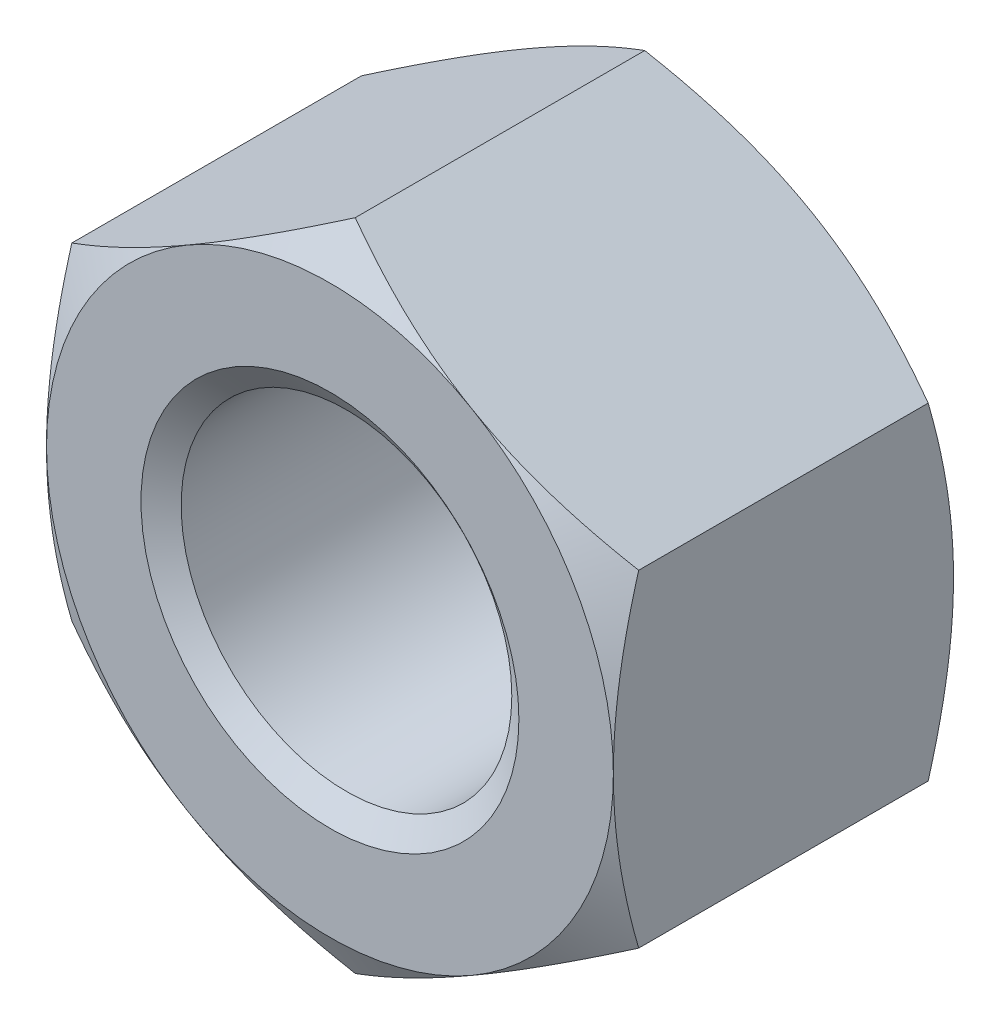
ISO-10303-21;
HEADER;
FILE_DESCRIPTION(('STEP AP214'),'2;1');
FILE_NAME('part.step','',(''),(''),'','','');
FILE_SCHEMA(('AUTOMOTIVE_DESIGN { 1 0 10303 214 1 1 1 1 }'));
ENDSEC;
DATA;
#1=APPLICATION_CONTEXT('core data for automotive mechanical design processes');
#2=APPLICATION_PROTOCOL_DEFINITION('international standard','automotive_design',2000,#1);
#3=PRODUCT_CONTEXT('',#1,'mechanical');
#4=PRODUCT('Part','Part','',(#3));
#5=PRODUCT_RELATED_PRODUCT_CATEGORY('part','',(#4));
#6=PRODUCT_DEFINITION_FORMATION('','',#4);
#7=PRODUCT_DEFINITION_CONTEXT('part definition',#1,'design');
#8=PRODUCT_DEFINITION('design','',#6,#7);
#9=PRODUCT_DEFINITION_SHAPE('','',#8);
#10=(LENGTH_UNIT() NAMED_UNIT(*) SI_UNIT(.MILLI.,.METRE.));
#11=(NAMED_UNIT(*) PLANE_ANGLE_UNIT() SI_UNIT($,.RADIAN.));
#12=(NAMED_UNIT(*) SI_UNIT($,.STERADIAN.) SOLID_ANGLE_UNIT());
#13=UNCERTAINTY_MEASURE_WITH_UNIT(LENGTH_MEASURE(1.E-05),#10,'distance_accuracy_value','');
#14=(GEOMETRIC_REPRESENTATION_CONTEXT(3) GLOBAL_UNCERTAINTY_ASSIGNED_CONTEXT((#13)) GLOBAL_UNIT_ASSIGNED_CONTEXT((#10,
#11,#12)) REPRESENTATION_CONTEXT('',''));
#15=CARTESIAN_POINT('',(0.,0.,0.));
#16=DIRECTION('',(0.,0.,1.));
#17=DIRECTION('',(1.,0.,0.));
#18=AXIS2_PLACEMENT_3D('',#15,#16,#17);
#19=CARTESIAN_POINT('',(0.,0.,-18.));
#20=DIRECTION('',(0.,0.,1.));
#21=DIRECTION('',(1.,0.,0.));
#22=AXIS2_PLACEMENT_3D('',#19,#20,#21);
#23=CYLINDRICAL_SURFACE('',#22,8.75);
#24=CARTESIAN_POINT('',(0.,0.,-0.875259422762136));
#25=DIRECTION('',(0.,0.,1.));
#26=DIRECTION('',(1.,0.,0.));
#27=AXIS2_PLACEMENT_3D('',#24,#25,#26);
#28=CIRCLE('',#27,8.75);
#29=CARTESIAN_POINT('',(8.75,0.,-0.875259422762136));
#30=VERTEX_POINT('',#29);
#31=EDGE_CURVE('E172',#30,#30,#28,.F.);
#32=ORIENTED_EDGE('',*,*,#31,.F.);
#33=EDGE_LOOP('',(#32));
#34=FACE_BOUND('',#33,.T.);
#35=CARTESIAN_POINT('',(0.,0.,-17.0993405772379));
#36=DIRECTION('',(0.,0.,-1.));
#37=DIRECTION('',(-1.,0.,0.));
#38=AXIS2_PLACEMENT_3D('',#35,#36,#37);
#39=CIRCLE('',#38,8.75);
#40=CARTESIAN_POINT('',(-8.75,0.,-17.0993405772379));
#41=VERTEX_POINT('',#40);
#42=EDGE_CURVE('E37',#41,#41,#39,.F.);
#43=ORIENTED_EDGE('',*,*,#42,.F.);
#44=EDGE_LOOP('',(#43));
#45=FACE_BOUND('',#44,.T.);
#46=ADVANCED_FACE('F32',(#34,#45),#23,.F.);
#47=CARTESIAN_POINT('',(0.,17.3205080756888,-18.));
#48=DIRECTION('',(0.,0.,-1.));
#49=DIRECTION('',(-1.,0.,0.));
#50=AXIS2_PLACEMENT_3D('',#47,#48,#49);
#51=PLANE('',#50);
#52=CARTESIAN_POINT('',(0.,0.,-18.));
#53=DIRECTION('',(0.,0.,-1.));
#54=DIRECTION('',(-1.,0.,0.));
#55=AXIS2_PLACEMENT_3D('',#52,#53,#54);
#56=CIRCLE('',#55,15.);
#57=CARTESIAN_POINT('',(-15.,0.,-18.));
#58=VERTEX_POINT('',#57);
#59=CARTESIAN_POINT('',(-7.50000000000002,-12.9903810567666,-18.));
#60=VERTEX_POINT('',#59);
#61=EDGE_CURVE('E168',#58,#60,#56,.F.);
#62=ORIENTED_EDGE('',*,*,#61,.F.);
#63=CARTESIAN_POINT('',(-7.50000000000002,12.9903810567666,-18.));
#64=VERTEX_POINT('',#63);
#65=EDGE_CURVE('E150',#64,#58,#56,.F.);
#66=ORIENTED_EDGE('',*,*,#65,.F.);
#67=CARTESIAN_POINT('',(7.50000000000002,12.9903810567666,-18.));
#68=VERTEX_POINT('',#67);
#69=EDGE_CURVE('E167',#68,#64,#56,.F.);
#70=ORIENTED_EDGE('',*,*,#69,.F.);
#71=CARTESIAN_POINT('',(0.,0.,-18.));
#72=DIRECTION('',(0.,0.,1.));
#73=DIRECTION('',(1.,0.,0.));
#74=AXIS2_PLACEMENT_3D('',#71,#72,#73);
#75=CIRCLE('',#74,15.);
#76=CARTESIAN_POINT('',(15.,0.,-18.));
#77=VERTEX_POINT('',#76);
#78=EDGE_CURVE('E242',#77,#68,#75,.T.);
#79=ORIENTED_EDGE('',*,*,#78,.F.);
#80=CARTESIAN_POINT('',(7.50000000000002,-12.9903810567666,-18.));
#81=VERTEX_POINT('',#80);
#82=EDGE_CURVE('E358',#81,#77,#56,.F.);
#83=ORIENTED_EDGE('',*,*,#82,.F.);
#84=EDGE_CURVE('E362',#60,#81,#56,.F.);
#85=ORIENTED_EDGE('',*,*,#84,.F.);
#86=EDGE_LOOP('',(#62,#66,#70,#79,#83,#85));
#87=FACE_BOUND('',#86,.T.);
#88=CARTESIAN_POINT('',(0.,0.,-18.));
#89=DIRECTION('',(0.,0.,-1.));
#90=DIRECTION('',(-1.,0.,0.));
#91=AXIS2_PLACEMENT_3D('',#88,#89,#90);
#92=CIRCLE('',#91,10.);
#93=CARTESIAN_POINT('',(-10.,0.,-18.));
#94=VERTEX_POINT('',#93);
#95=EDGE_CURVE('E175',#94,#94,#92,.F.);
#96=ORIENTED_EDGE('',*,*,#95,.T.);
#97=EDGE_LOOP('',(#96));
#98=FACE_BOUND('',#97,.T.);
#99=ADVANCED_FACE('F295',(#87,#98),#51,.T.);
#100=CARTESIAN_POINT('',(0.,17.3205080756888,0.));
#101=DIRECTION('',(0.,0.,-1.));
#102=DIRECTION('',(-1.,0.,0.));
#103=AXIS2_PLACEMENT_3D('',#100,#101,#102);
#104=PLANE('',#103);
#105=CARTESIAN_POINT('',(0.,0.,0.));
#106=DIRECTION('',(0.,0.,-1.));
#107=DIRECTION('',(-1.,0.,0.));
#108=AXIS2_PLACEMENT_3D('',#105,#106,#107);
#109=CIRCLE('',#108,15.);
#110=CARTESIAN_POINT('',(-15.,0.,0.));
#111=VERTEX_POINT('',#110);
#112=CARTESIAN_POINT('',(-7.50000000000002,12.9903810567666,0.));
#113=VERTEX_POINT('',#112);
#114=EDGE_CURVE('E11',#111,#113,#109,.T.);
#115=ORIENTED_EDGE('',*,*,#114,.F.);
#116=CARTESIAN_POINT('',(-7.50000000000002,-12.9903810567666,0.));
#117=VERTEX_POINT('',#116);
#118=EDGE_CURVE('E44',#117,#111,#109,.T.);
#119=ORIENTED_EDGE('',*,*,#118,.F.);
#120=CARTESIAN_POINT('',(7.50000000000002,-12.9903810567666,0.));
#121=VERTEX_POINT('',#120);
#122=EDGE_CURVE('E171',#121,#117,#109,.T.);
#123=ORIENTED_EDGE('',*,*,#122,.F.);
#124=CARTESIAN_POINT('',(15.,0.,0.));
#125=VERTEX_POINT('',#124);
#126=EDGE_CURVE('E349',#125,#121,#109,.T.);
#127=ORIENTED_EDGE('',*,*,#126,.F.);
#128=CARTESIAN_POINT('',(0.,0.,0.));
#129=DIRECTION('',(0.,0.,1.));
#130=DIRECTION('',(1.,0.,0.));
#131=AXIS2_PLACEMENT_3D('',#128,#129,#130);
#132=CIRCLE('',#131,15.);
#133=CARTESIAN_POINT('',(7.50000000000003,12.9903810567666,0.));
#134=VERTEX_POINT('',#133);
#135=EDGE_CURVE('E126',#125,#134,#132,.T.);
#136=ORIENTED_EDGE('',*,*,#135,.T.);
#137=EDGE_CURVE('E42',#113,#134,#109,.T.);
#138=ORIENTED_EDGE('',*,*,#137,.F.);
#139=EDGE_LOOP('',(#115,#119,#123,#127,#136,#138));
#140=FACE_BOUND('',#139,.T.);
#141=CARTESIAN_POINT('',(0.,0.,0.));
#142=DIRECTION('',(0.,0.,1.));
#143=DIRECTION('',(1.,0.,0.));
#144=AXIS2_PLACEMENT_3D('',#141,#142,#143);
#145=CIRCLE('',#144,10.);
#146=CARTESIAN_POINT('',(10.,0.,0.));
#147=VERTEX_POINT('',#146);
#148=EDGE_CURVE('E174',#147,#147,#145,.T.);
#149=ORIENTED_EDGE('',*,*,#148,.F.);
#150=EDGE_LOOP('',(#149));
#151=FACE_BOUND('',#150,.T.);
#152=ADVANCED_FACE('F247',(#140,#151),#104,.F.);
#153=CARTESIAN_POINT('',(0.,17.3205080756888,-18.));
#154=DIRECTION('',(-0.500000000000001,0.866025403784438,0.));
#155=DIRECTION('',(-0.866025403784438,-0.500000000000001,0.));
#156=AXIS2_PLACEMENT_3D('',#153,#154,#155);
#157=PLANE('',#156);
#158=DIRECTION('',(0.,0.,1.));
#159=VECTOR('',#158,1.);
#160=CARTESIAN_POINT('',(-15.,8.66025403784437,-18.));
#161=LINE('',#160,#159);
#162=CARTESIAN_POINT('',(-15.,8.66025403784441,-16.6602540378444));
#163=VERTEX_POINT('',#162);
#164=CARTESIAN_POINT('',(-15.,8.66025403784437,-1.33974596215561));
#165=VERTEX_POINT('',#164);
#166=EDGE_CURVE('E162',#163,#165,#161,.T.);
#167=ORIENTED_EDGE('',*,*,#166,.T.);
#168=CARTESIAN_POINT('',(-15.0002,8.66013856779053,-1.33981262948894));
#169=CARTESIAN_POINT('',(-14.6705058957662,8.85048754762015,-1.22992178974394));
#170=CARTESIAN_POINT('',(-14.3395258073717,9.04157899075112,-1.12501758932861));
#171=CARTESIAN_POINT('',(-13.674911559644,9.42529420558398,-0.926568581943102));
#172=CARTESIAN_POINT('',(-13.3412765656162,9.617918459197,-0.833027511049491));
#173=CARTESIAN_POINT('',(-12.6707077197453,10.0050715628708,-0.658562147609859));
#174=CARTESIAN_POINT('',(-12.333767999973,10.199603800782,-0.577667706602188));
#175=CARTESIAN_POINT('',(-11.6575472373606,10.5900200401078,-0.430232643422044));
#176=CARTESIAN_POINT('',(-11.3182663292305,10.7859039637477,-0.363691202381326));
#177=CARTESIAN_POINT('',(-10.6460568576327,11.1740042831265,-0.247792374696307));
#178=CARTESIAN_POINT('',(-10.3131781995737,11.3661918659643,-0.198051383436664));
#179=CARTESIAN_POINT('',(-9.64589556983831,11.7514476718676,-0.114646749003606));
#180=CARTESIAN_POINT('',(-9.31149156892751,11.9445159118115,-0.0809834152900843));
#181=CARTESIAN_POINT('',(-8.64212181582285,12.3309767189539,-0.0305840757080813));
#182=CARTESIAN_POINT('',(-8.30715720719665,12.5243686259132,-0.0138279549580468));
#183=CARTESIAN_POINT('',(-7.636918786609,12.9113309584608,0.00239660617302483));
#184=CARTESIAN_POINT('',(-7.30164498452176,13.1049013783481,0.00186558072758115));
#185=CARTESIAN_POINT('',(-6.6748531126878,13.4667798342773,-0.0152766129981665));
#186=CARTESIAN_POINT('',(-6.38329037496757,13.6351136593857,-0.0297968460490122));
#187=CARTESIAN_POINT('',(-5.80083556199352,13.9713941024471,-0.0716371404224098));
#188=CARTESIAN_POINT('',(-5.50994353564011,14.1393406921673,-0.0989581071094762));
#189=CARTESIAN_POINT('',(-4.92898814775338,14.4747554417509,-0.165923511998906));
#190=CARTESIAN_POINT('',(-4.63892567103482,14.6422230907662,-0.205578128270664));
#191=CARTESIAN_POINT('',(-4.06016058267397,14.9763732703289,-0.296515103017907));
#192=CARTESIAN_POINT('',(-3.77145806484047,15.1430557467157,-0.347798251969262));
#193=CARTESIAN_POINT('',(-2.89508556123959,15.6490296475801,-0.520386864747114));
#194=CARTESIAN_POINT('',(-2.30995340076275,15.9868558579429,-0.658901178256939));
#195=CARTESIAN_POINT('',(-1.14841408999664,16.6574708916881,-0.973271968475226));
#196=CARTESIAN_POINT('',(-0.571992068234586,16.9902683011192,-1.14905461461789));
#197=CARTESIAN_POINT('',(0.000199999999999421,17.3206235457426,-1.33981262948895));
#198=B_SPLINE_CURVE_WITH_KNOTS('',3,(#168,#169,#170,#171,#172,#173,#174,#175,#176,#177,#178,
#179,#180,#181,#182,#183,#184,#185,#186,#187,#188,#189,#190,#191,#192,#193,#194,#195,#196,#197),
.UNSPECIFIED.,.F.,.F.,(4,2,2,2,2,2,2,2,2,2,2,2,2,2,4),(0.,1.18875411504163,2.37789802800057,
3.56980778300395,4.76164951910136,5.92407379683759,7.08652044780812,8.24758247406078,
9.40860862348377,10.4193068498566,11.4300765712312,12.4416826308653,13.4533574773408,
15.5211962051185,17.5849760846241),.UNSPECIFIED.);
#199=EDGE_CURVE('E131',#165,#113,#198,.T.);
#200=ORIENTED_EDGE('',*,*,#199,.T.);
#201=CARTESIAN_POINT('',(0.,17.3205080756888,-1.33974596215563));
#202=VERTEX_POINT('',#201);
#203=EDGE_CURVE('E51',#113,#202,#198,.T.);
#204=ORIENTED_EDGE('',*,*,#203,.T.);
#205=DIRECTION('',(0.,0.,1.));
#206=VECTOR('',#205,1.);
#207=CARTESIAN_POINT('',(0.,17.3205080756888,-18.));
#208=LINE('',#207,#206);
#209=CARTESIAN_POINT('',(0.,17.3205080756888,-16.6602540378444));
#210=VERTEX_POINT('',#209);
#211=EDGE_CURVE('E147',#210,#202,#208,.T.);
#212=ORIENTED_EDGE('',*,*,#211,.F.);
#213=CARTESIAN_POINT('',(-15.0002,8.66013856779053,-16.6601873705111));
#214=CARTESIAN_POINT('',(-14.6705058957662,8.85048754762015,-16.7700782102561));
#215=CARTESIAN_POINT('',(-14.3395258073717,9.04157899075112,-16.8749824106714));
#216=CARTESIAN_POINT('',(-13.674911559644,9.42529420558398,-17.0734314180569));
#217=CARTESIAN_POINT('',(-13.3412765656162,9.617918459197,-17.1669724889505));
#218=CARTESIAN_POINT('',(-12.6707077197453,10.0050715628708,-17.3414378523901));
#219=CARTESIAN_POINT('',(-12.333767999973,10.199603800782,-17.4223322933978));
#220=CARTESIAN_POINT('',(-11.6575472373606,10.5900200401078,-17.569767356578));
#221=CARTESIAN_POINT('',(-11.3182663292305,10.7859039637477,-17.6363087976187));
#222=CARTESIAN_POINT('',(-10.6460568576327,11.1740042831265,-17.7522076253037));
#223=CARTESIAN_POINT('',(-10.3131781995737,11.3661918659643,-17.8019486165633));
#224=CARTESIAN_POINT('',(-9.6458955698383,11.7514476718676,-17.8853532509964));
#225=CARTESIAN_POINT('',(-9.31149156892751,11.9445159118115,-17.9190165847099));
#226=CARTESIAN_POINT('',(-8.64212181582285,12.3309767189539,-17.9694159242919));
#227=CARTESIAN_POINT('',(-8.30715720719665,12.5243686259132,-17.986172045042));
#228=CARTESIAN_POINT('',(-7.636918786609,12.9113309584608,-18.002396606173));
#229=CARTESIAN_POINT('',(-7.30164498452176,13.1049013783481,-18.0018655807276));
#230=CARTESIAN_POINT('',(-6.6748531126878,13.4667798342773,-17.9847233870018));
#231=CARTESIAN_POINT('',(-6.38329037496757,13.6351136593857,-17.970203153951));
#232=CARTESIAN_POINT('',(-5.80083556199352,13.9713941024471,-17.9283628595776));
#233=CARTESIAN_POINT('',(-5.50994353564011,14.1393406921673,-17.9010418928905));
#234=CARTESIAN_POINT('',(-4.92898814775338,14.4747554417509,-17.8340764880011));
#235=CARTESIAN_POINT('',(-4.63892567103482,14.6422230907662,-17.7944218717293));
#236=CARTESIAN_POINT('',(-4.06016058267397,14.9763732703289,-17.7034848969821));
#237=CARTESIAN_POINT('',(-3.77145806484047,15.1430557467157,-17.6522017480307));
#238=CARTESIAN_POINT('',(-2.89508556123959,15.6490296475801,-17.4796131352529));
#239=CARTESIAN_POINT('',(-2.30995340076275,15.9868558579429,-17.3410988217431));
#240=CARTESIAN_POINT('',(-1.14841408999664,16.6574708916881,-17.0267280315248));
#241=CARTESIAN_POINT('',(-0.571992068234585,16.9902683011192,-16.8509453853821));
#242=CARTESIAN_POINT('',(0.000200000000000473,17.3206235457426,-16.660187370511));
#243=B_SPLINE_CURVE_WITH_KNOTS('',3,(#213,#214,#215,#216,#217,#218,#219,#220,#221,#222,#223,
#224,#225,#226,#227,#228,#229,#230,#231,#232,#233,#234,#235,#236,#237,#238,#239,#240,#241,#242),
.UNSPECIFIED.,.F.,.F.,(4,2,2,2,2,2,2,2,2,2,2,2,2,2,4),(0.,1.18875411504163,2.37789802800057,
3.56980778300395,4.76164951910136,5.92407379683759,7.08652044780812,8.24758247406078,
9.40860862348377,10.4193068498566,11.4300765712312,12.4416826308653,13.4533574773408,
15.5211962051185,17.5849760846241),.UNSPECIFIED.);
#244=EDGE_CURVE('E165',#64,#210,#243,.T.);
#245=ORIENTED_EDGE('',*,*,#244,.F.);
#246=EDGE_CURVE('E257',#163,#64,#243,.T.);
#247=ORIENTED_EDGE('',*,*,#246,.F.);
#248=EDGE_LOOP('',(#167,#200,#204,#212,#245,#247));
#249=FACE_BOUND('',#248,.T.);
#250=ADVANCED_FACE('F34',(#249),#157,.T.);
#251=CARTESIAN_POINT('',(15.,8.66025403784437,-18.));
#252=DIRECTION('',(0.500000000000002,0.866025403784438,0.));
#253=DIRECTION('',(-0.866025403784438,0.500000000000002,0.));
#254=AXIS2_PLACEMENT_3D('',#251,#252,#253);
#255=PLANE('',#254);
#256=ORIENTED_EDGE('',*,*,#211,.T.);
#257=CARTESIAN_POINT('',(-0.000199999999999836,17.3206235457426,-1.33981262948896));
#258=CARTESIAN_POINT('',(0.329494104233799,17.130274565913,-1.22992178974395));
#259=CARTESIAN_POINT('',(0.6604741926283,16.939183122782,-1.12501758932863));
#260=CARTESIAN_POINT('',(1.32508844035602,16.5554679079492,-0.926568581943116));
#261=CARTESIAN_POINT('',(1.6587234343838,16.3628436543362,-0.833027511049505));
#262=CARTESIAN_POINT('',(2.32929228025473,15.9756905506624,-0.658562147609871));
#263=CARTESIAN_POINT('',(2.66623200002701,15.7811583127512,-0.577667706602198));
#264=CARTESIAN_POINT('',(3.34245276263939,15.3907420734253,-0.430232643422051));
#265=CARTESIAN_POINT('',(3.68173367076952,15.1948581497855,-0.363691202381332));
#266=CARTESIAN_POINT('',(4.35394314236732,14.8067578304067,-0.247792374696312));
#267=CARTESIAN_POINT('',(4.68682180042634,14.6145702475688,-0.198051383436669));
#268=CARTESIAN_POINT('',(5.3541044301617,14.2293144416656,-0.11464674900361));
#269=CARTESIAN_POINT('',(5.6885084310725,14.0362462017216,-0.0809834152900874));
#270=CARTESIAN_POINT('',(6.35787818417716,13.6497853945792,-0.0305840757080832));
#271=CARTESIAN_POINT('',(6.69284279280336,13.4563934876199,-0.0138279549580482));
#272=CARTESIAN_POINT('',(7.36308121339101,13.0694311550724,0.00239660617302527));
#273=CARTESIAN_POINT('',(7.69835501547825,12.8758607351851,0.00186558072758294));
#274=CARTESIAN_POINT('',(8.32514688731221,12.5139822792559,-0.0152766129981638));
#275=CARTESIAN_POINT('',(8.61670962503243,12.3456484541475,-0.0297968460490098));
#276=CARTESIAN_POINT('',(9.19916443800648,12.0093680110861,-0.0716371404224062));
#277=CARTESIAN_POINT('',(9.49005646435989,11.8414214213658,-0.0989581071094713));
#278=CARTESIAN_POINT('',(10.0710118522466,11.5060066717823,-0.1659235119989));
#279=CARTESIAN_POINT('',(10.3610743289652,11.338539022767,-0.205578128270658));
#280=CARTESIAN_POINT('',(10.939839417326,11.0043888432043,-0.2965151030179));
#281=CARTESIAN_POINT('',(11.2285419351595,10.8377063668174,-0.347798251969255));
#282=CARTESIAN_POINT('',(12.1049144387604,10.331732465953,-0.520386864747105));
#283=CARTESIAN_POINT('',(12.6900465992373,9.99390625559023,-0.658901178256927));
#284=CARTESIAN_POINT('',(13.8515859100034,9.32329122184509,-0.973271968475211));
#285=CARTESIAN_POINT('',(14.4280079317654,8.99049381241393,-1.14905461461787));
#286=CARTESIAN_POINT('',(15.0002,8.66013856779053,-1.33981262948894));
#287=B_SPLINE_CURVE_WITH_KNOTS('',3,(#257,#258,#259,#260,#261,#262,#263,#264,#265,#266,#267,
#268,#269,#270,#271,#272,#273,#274,#275,#276,#277,#278,#279,#280,#281,#282,#283,#284,#285,#286),
.UNSPECIFIED.,.F.,.F.,(4,2,2,2,2,2,2,2,2,2,2,2,2,2,4),(0.,1.18875411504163,2.37789802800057,
3.56980778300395,4.76164951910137,5.9240737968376,7.08652044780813,8.2475824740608,
9.40860862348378,10.4193068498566,11.4300765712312,12.4416826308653,13.4533574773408,
15.5211962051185,17.5849760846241),.UNSPECIFIED.);
#288=EDGE_CURVE('E141',#202,#134,#287,.T.);
#289=ORIENTED_EDGE('',*,*,#288,.T.);
#290=CARTESIAN_POINT('',(15.,8.66025403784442,-1.33974596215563));
#291=VERTEX_POINT('',#290);
#292=EDGE_CURVE('E58',#134,#291,#287,.T.);
#293=ORIENTED_EDGE('',*,*,#292,.T.);
#294=DIRECTION('',(0.,0.,1.));
#295=VECTOR('',#294,1.);
#296=CARTESIAN_POINT('',(15.,8.66025403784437,-18.));
#297=LINE('',#296,#295);
#298=CARTESIAN_POINT('',(15.,8.66025403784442,-16.6602540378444));
#299=VERTEX_POINT('',#298);
#300=EDGE_CURVE('E140',#299,#291,#297,.T.);
#301=ORIENTED_EDGE('',*,*,#300,.F.);
#302=CARTESIAN_POINT('',(-0.000199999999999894,17.3206235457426,-16.660187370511));
#303=CARTESIAN_POINT('',(0.329494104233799,17.130274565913,-16.770078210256));
#304=CARTESIAN_POINT('',(0.660474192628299,16.939183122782,-16.8749824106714));
#305=CARTESIAN_POINT('',(1.32508844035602,16.5554679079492,-17.0734314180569));
#306=CARTESIAN_POINT('',(1.6587234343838,16.3628436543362,-17.1669724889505));
#307=CARTESIAN_POINT('',(2.32929228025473,15.9756905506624,-17.3414378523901));
#308=CARTESIAN_POINT('',(2.66623200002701,15.7811583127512,-17.4223322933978));
#309=CARTESIAN_POINT('',(3.34245276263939,15.3907420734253,-17.5697673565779));
#310=CARTESIAN_POINT('',(3.68173367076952,15.1948581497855,-17.6363087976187));
#311=CARTESIAN_POINT('',(4.35394314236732,14.8067578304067,-17.7522076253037));
#312=CARTESIAN_POINT('',(4.68682180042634,14.6145702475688,-17.8019486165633));
#313=CARTESIAN_POINT('',(5.3541044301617,14.2293144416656,-17.8853532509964));
#314=CARTESIAN_POINT('',(5.6885084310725,14.0362462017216,-17.9190165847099));
#315=CARTESIAN_POINT('',(6.35787818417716,13.6497853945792,-17.9694159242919));
#316=CARTESIAN_POINT('',(6.69284279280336,13.4563934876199,-17.986172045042));
#317=CARTESIAN_POINT('',(7.36308121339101,13.0694311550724,-18.002396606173));
#318=CARTESIAN_POINT('',(7.69835501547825,12.8758607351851,-18.0018655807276));
#319=CARTESIAN_POINT('',(8.32514688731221,12.5139822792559,-17.9847233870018));
#320=CARTESIAN_POINT('',(8.61670962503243,12.3456484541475,-17.970203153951));
#321=CARTESIAN_POINT('',(9.19916443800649,12.0093680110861,-17.9283628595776));
#322=CARTESIAN_POINT('',(9.49005646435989,11.8414214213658,-17.9010418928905));
#323=CARTESIAN_POINT('',(10.0710118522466,11.5060066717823,-17.8340764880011));
#324=CARTESIAN_POINT('',(10.3610743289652,11.338539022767,-17.7944218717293));
#325=CARTESIAN_POINT('',(10.939839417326,11.0043888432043,-17.7034848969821));
#326=CARTESIAN_POINT('',(11.2285419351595,10.8377063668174,-17.6522017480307));
#327=CARTESIAN_POINT('',(12.1049144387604,10.331732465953,-17.4796131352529));
#328=CARTESIAN_POINT('',(12.6900465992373,9.99390625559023,-17.3410988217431));
#329=CARTESIAN_POINT('',(13.8515859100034,9.32329122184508,-17.0267280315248));
#330=CARTESIAN_POINT('',(14.4280079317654,8.99049381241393,-16.8509453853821));
#331=CARTESIAN_POINT('',(15.0002,8.66013856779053,-16.6601873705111));
#332=B_SPLINE_CURVE_WITH_KNOTS('',3,(#302,#303,#304,#305,#306,#307,#308,#309,#310,#311,#312,
#313,#314,#315,#316,#317,#318,#319,#320,#321,#322,#323,#324,#325,#326,#327,#328,#329,#330,#331),
.UNSPECIFIED.,.F.,.F.,(4,2,2,2,2,2,2,2,2,2,2,2,2,2,4),(0.,1.18875411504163,2.37789802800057,
3.56980778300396,4.76164951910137,5.9240737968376,7.08652044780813,8.2475824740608,
9.40860862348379,10.4193068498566,11.4300765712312,12.4416826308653,13.4533574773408,
15.5211962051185,17.5849760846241),.UNSPECIFIED.);
#333=EDGE_CURVE('E251',#68,#299,#332,.T.);
#334=ORIENTED_EDGE('',*,*,#333,.F.);
#335=EDGE_CURVE('E256',#210,#68,#332,.T.);
#336=ORIENTED_EDGE('',*,*,#335,.F.);
#337=EDGE_LOOP('',(#256,#289,#293,#301,#334,#336));
#338=FACE_BOUND('',#337,.T.);
#339=ADVANCED_FACE('F138',(#338),#255,.T.);
#340=CARTESIAN_POINT('',(15.,8.66025403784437,-18.));
#341=DIRECTION('',(-1.,0.,0.));
#342=DIRECTION('',(0.,0.,1.));
#343=AXIS2_PLACEMENT_3D('',#340,#341,#342);
#344=PLANE('',#343);
#345=CARTESIAN_POINT('',(15.,-22.9682699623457,-7.17790057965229));
#346=CARTESIAN_POINT('',(15.,-22.6389897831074,-7.01873142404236));
#347=CARTESIAN_POINT('',(15.,-22.3093116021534,-6.8603860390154));
#348=CARTESIAN_POINT('',(15.,-21.6490751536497,-6.54553189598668));
#349=CARTESIAN_POINT('',(15.,-21.3185168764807,-6.38902315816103));
#350=CARTESIAN_POINT('',(15.,-20.3252989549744,-5.92249019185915));
#351=CARTESIAN_POINT('',(15.,-19.6612032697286,-5.61551110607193));
#352=CARTESIAN_POINT('',(15.,-18.3246226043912,-5.0098985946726));
#353=CARTESIAN_POINT('',(15.,-17.6521113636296,-4.71132298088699));
#354=CARTESIAN_POINT('',(15.,-16.3015621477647,-4.12699119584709));
#355=CARTESIAN_POINT('',(15.,-15.6235244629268,-3.84123435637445));
#356=CARTESIAN_POINT('',(15.,-14.2524269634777,-3.28256457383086));
#357=CARTESIAN_POINT('',(15.,-13.5592849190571,-3.00985238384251));
#358=CARTESIAN_POINT('',(15.,-12.1648203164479,-2.48578579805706));
#359=CARTESIAN_POINT('',(15.,-11.4634968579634,-2.2344337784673));
#360=CARTESIAN_POINT('',(15.,-10.0530172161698,-1.75984469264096));
#361=CARTESIAN_POINT('',(15.,-9.34388131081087,-1.53654785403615));
#362=CARTESIAN_POINT('',(15.,-7.91545988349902,-1.12531011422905));
#363=CARTESIAN_POINT('',(15.,-7.19617764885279,-0.937358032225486));
#364=CARTESIAN_POINT('',(15.,-6.10950776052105,-0.688818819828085));
#365=CARTESIAN_POINT('',(15.,-5.74591626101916,-0.611524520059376));
#366=CARTESIAN_POINT('',(15.,-5.01631310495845,-0.469286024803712));
#367=CARTESIAN_POINT('',(15.,-4.65030150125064,-0.40434156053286));
#368=CARTESIAN_POINT('',(15.,-3.91609659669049,-0.287952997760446));
#369=CARTESIAN_POINT('',(15.,-3.54790312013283,-0.236510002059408));
#370=CARTESIAN_POINT('',(15.,-2.80977894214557,-0.148161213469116));
#371=CARTESIAN_POINT('',(15.,-2.43984831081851,-0.111254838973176));
#372=CARTESIAN_POINT('',(15.,-1.70111543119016,-0.0529692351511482));
#373=CARTESIAN_POINT('',(15.,-1.33232087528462,-0.0314931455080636));
#374=CARTESIAN_POINT('',(15.,-0.594154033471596,-0.00418216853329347));
#375=CARTESIAN_POINT('',(15.,-0.224781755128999,0.00165292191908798));
#376=CARTESIAN_POINT('',(15.,0.513772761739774,-0.0024565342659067));
#377=CARTESIAN_POINT('',(15.,0.882955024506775,-0.0123966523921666));
#378=CARTESIAN_POINT('',(15.,1.6205787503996,-0.0478095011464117));
#379=CARTESIAN_POINT('',(15.,1.98902017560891,-0.0732830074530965));
#380=CARTESIAN_POINT('',(15.,2.88200878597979,-0.153315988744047));
#381=CARTESIAN_POINT('',(15.,3.40586988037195,-0.215658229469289));
#382=CARTESIAN_POINT('',(15.,4.44957771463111,-0.368284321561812));
#383=CARTESIAN_POINT('',(15.,4.96942331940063,-0.458575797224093));
#384=CARTESIAN_POINT('',(15.,6.00467140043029,-0.663898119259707));
#385=CARTESIAN_POINT('',(15.,6.52006919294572,-0.778952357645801));
#386=CARTESIAN_POINT('',(15.,7.54556200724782,-1.03028935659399));
#387=CARTESIAN_POINT('',(15.,8.05565752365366,-1.16657011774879));
#388=CARTESIAN_POINT('',(15.,9.0831096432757,-1.46066370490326));
#389=CARTESIAN_POINT('',(15.,9.60033774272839,-1.61892244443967));
#390=CARTESIAN_POINT('',(15.,10.6293258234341,-1.95107200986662));
#391=CARTESIAN_POINT('',(15.,11.1410893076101,-2.12495205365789));
#392=CARTESIAN_POINT('',(15.,12.1570993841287,-2.48477464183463));
#393=CARTESIAN_POINT('',(15.,12.6613720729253,-2.67064378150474));
#394=CARTESIAN_POINT('',(15.,13.4147912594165,-2.95756327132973));
#395=CARTESIAN_POINT('',(15.,13.665486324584,-3.05457748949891));
#396=CARTESIAN_POINT('',(15.,14.1659013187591,-3.25107322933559));
#397=CARTESIAN_POINT('',(15.,14.4156212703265,-3.35055469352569));
#398=CARTESIAN_POINT('',(15.,14.6648887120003,-3.45115877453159));
#399=B_SPLINE_CURVE_WITH_KNOTS('',3,(#345,#346,#347,#348,#349,#350,#351,#352,#353,#354,#355,
#356,#357,#358,#359,#360,#361,#362,#363,#364,#365,#366,#367,#368,#369,#370,#371,#372,#373,#374,
#375,#376,#377,#378,#379,#380,#381,#382,#383,#384,#385,#386,#387,#388,#389,#390,#391,#392,#393,
#394,#395,#396,#397,#398),.UNSPECIFIED.,.F.,.F.,(4,2,2,2,2,2,2,2,2,2,2,2,2,2,2,2,2,2,2,2,2,2,2,
2,2,2,4),(0.,1.09719534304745,2.19440272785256,4.38917437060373,6.59650580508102,
8.80372204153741,11.0380360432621,13.2725982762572,15.502315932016,17.7313270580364,
18.8463006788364,19.9612500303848,21.0762904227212,22.1912861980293,23.2992201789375,
24.4071397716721,25.5147483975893,26.6224123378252,28.2042036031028,29.7864267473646,
31.3701511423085,32.9537264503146,34.5761185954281,36.1973994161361,37.8095545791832,
38.6159794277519,39.4223855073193),.UNSPECIFIED.);
#400=CARTESIAN_POINT('',(15.,-8.66025403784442,-1.33974596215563));
#401=VERTEX_POINT('',#400);
#402=EDGE_CURVE('E133',#401,#125,#399,.T.);
#403=ORIENTED_EDGE('',*,*,#402,.F.);
#404=DIRECTION('',(0.,0.,1.));
#405=VECTOR('',#404,1.);
#406=CARTESIAN_POINT('',(15.,-8.66025403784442,-18.));
#407=LINE('',#406,#405);
#408=CARTESIAN_POINT('',(15.,-8.66025403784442,-16.6602540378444));
#409=VERTEX_POINT('',#408);
#410=EDGE_CURVE('E148',#409,#401,#407,.T.);
#411=ORIENTED_EDGE('',*,*,#410,.F.);
#412=CARTESIAN_POINT('',(15.,-22.9682699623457,-10.8220994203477));
#413=CARTESIAN_POINT('',(15.,-22.6389897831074,-10.9812685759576));
#414=CARTESIAN_POINT('',(15.,-22.3093116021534,-11.1396139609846));
#415=CARTESIAN_POINT('',(15.,-21.6490751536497,-11.4544681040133));
#416=CARTESIAN_POINT('',(15.,-21.3185168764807,-11.610976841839));
#417=CARTESIAN_POINT('',(15.,-20.3252989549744,-12.0775098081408));
#418=CARTESIAN_POINT('',(15.,-19.6612032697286,-12.3844888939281));
#419=CARTESIAN_POINT('',(15.,-18.3246226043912,-12.9901014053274));
#420=CARTESIAN_POINT('',(15.,-17.6521113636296,-13.288677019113));
#421=CARTESIAN_POINT('',(15.,-16.3015621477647,-13.8730088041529));
#422=CARTESIAN_POINT('',(15.,-15.6235244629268,-14.1587656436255));
#423=CARTESIAN_POINT('',(15.,-14.2524269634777,-14.7174354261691));
#424=CARTESIAN_POINT('',(15.,-13.5592849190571,-14.9901476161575));
#425=CARTESIAN_POINT('',(15.,-12.1648203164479,-15.5142142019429));
#426=CARTESIAN_POINT('',(15.,-11.4634968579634,-15.7655662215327));
#427=CARTESIAN_POINT('',(15.,-10.0530172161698,-16.240155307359));
#428=CARTESIAN_POINT('',(15.,-9.34388131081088,-16.4634521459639));
#429=CARTESIAN_POINT('',(15.,-7.91545988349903,-16.874689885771));
#430=CARTESIAN_POINT('',(15.,-7.1961776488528,-17.0626419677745));
#431=CARTESIAN_POINT('',(15.,-6.10950776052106,-17.3111811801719));
#432=CARTESIAN_POINT('',(15.,-5.74591626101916,-17.3884754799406));
#433=CARTESIAN_POINT('',(15.,-5.01631310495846,-17.5307139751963));
#434=CARTESIAN_POINT('',(15.,-4.65030150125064,-17.5956584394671));
#435=CARTESIAN_POINT('',(15.,-3.91609659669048,-17.7120470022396));
#436=CARTESIAN_POINT('',(15.,-3.54790312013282,-17.7634899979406));
#437=CARTESIAN_POINT('',(15.,-2.80977894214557,-17.8518387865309));
#438=CARTESIAN_POINT('',(15.,-2.4398483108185,-17.8887451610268));
#439=CARTESIAN_POINT('',(15.,-1.70111543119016,-17.9470307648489));
#440=CARTESIAN_POINT('',(15.,-1.33232087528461,-17.9685068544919));
#441=CARTESIAN_POINT('',(15.,-0.594154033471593,-17.9958178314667));
#442=CARTESIAN_POINT('',(15.,-0.224781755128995,-18.0016529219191));
#443=CARTESIAN_POINT('',(15.,0.513772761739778,-17.9975434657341));
#444=CARTESIAN_POINT('',(15.,0.882955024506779,-17.9876033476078));
#445=CARTESIAN_POINT('',(15.,1.62057875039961,-17.9521904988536));
#446=CARTESIAN_POINT('',(15.,1.98902017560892,-17.9267169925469));
#447=CARTESIAN_POINT('',(15.,2.88200878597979,-17.846684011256));
#448=CARTESIAN_POINT('',(15.,3.40586988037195,-17.7843417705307));
#449=CARTESIAN_POINT('',(15.,4.44957771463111,-17.6317156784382));
#450=CARTESIAN_POINT('',(15.,4.96942331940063,-17.5414242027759));
#451=CARTESIAN_POINT('',(15.,6.00467140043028,-17.3361018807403));
#452=CARTESIAN_POINT('',(15.,6.52006919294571,-17.2210476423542));
#453=CARTESIAN_POINT('',(15.,7.54556200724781,-16.969710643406));
#454=CARTESIAN_POINT('',(15.,8.05565752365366,-16.8334298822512));
#455=CARTESIAN_POINT('',(15.,9.08310964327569,-16.5393362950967));
#456=CARTESIAN_POINT('',(15.,9.60033774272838,-16.3810775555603));
#457=CARTESIAN_POINT('',(15.,10.6293258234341,-16.0489279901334));
#458=CARTESIAN_POINT('',(15.,11.1410893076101,-15.8750479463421));
#459=CARTESIAN_POINT('',(15.,12.1570993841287,-15.5152253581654));
#460=CARTESIAN_POINT('',(15.,12.6613720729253,-15.3293562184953));
#461=CARTESIAN_POINT('',(15.,13.4147912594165,-15.0424367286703));
#462=CARTESIAN_POINT('',(15.,13.665486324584,-14.9454225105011));
#463=CARTESIAN_POINT('',(15.,14.1659013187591,-14.7489267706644));
#464=CARTESIAN_POINT('',(15.,14.4156212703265,-14.6494453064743));
#465=CARTESIAN_POINT('',(15.,14.6648887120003,-14.5488412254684));
#466=B_SPLINE_CURVE_WITH_KNOTS('',3,(#412,#413,#414,#415,#416,#417,#418,#419,#420,#421,#422,
#423,#424,#425,#426,#427,#428,#429,#430,#431,#432,#433,#434,#435,#436,#437,#438,#439,#440,#441,
#442,#443,#444,#445,#446,#447,#448,#449,#450,#451,#452,#453,#454,#455,#456,#457,#458,#459,#460,
#461,#462,#463,#464,#465),.UNSPECIFIED.,.F.,.F.,(4,2,2,2,2,2,2,2,2,2,2,2,2,2,2,2,2,2,2,2,2,2,2,
2,2,2,4),(0.,1.09719534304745,2.19440272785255,4.38917437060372,6.59650580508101,
8.80372204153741,11.0380360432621,13.2725982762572,15.502315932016,17.7313270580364,
18.8463006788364,19.9612500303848,21.0762904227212,22.1912861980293,23.2992201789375,
24.4071397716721,25.5147483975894,26.6224123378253,28.2042036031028,29.7864267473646,
31.3701511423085,32.9537264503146,34.5761185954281,36.1973994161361,37.8095545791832,
38.6159794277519,39.4223855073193),.UNSPECIFIED.);
#467=EDGE_CURVE('E263',#409,#77,#466,.T.);
#468=ORIENTED_EDGE('',*,*,#467,.T.);
#469=EDGE_CURVE('E146',#77,#299,#466,.T.);
#470=ORIENTED_EDGE('',*,*,#469,.T.);
#471=ORIENTED_EDGE('',*,*,#300,.T.);
#472=EDGE_CURVE('E123',#125,#291,#399,.T.);
#473=ORIENTED_EDGE('',*,*,#472,.F.);
#474=EDGE_LOOP('',(#403,#411,#468,#470,#471,#473));
#475=FACE_BOUND('',#474,.T.);
#476=ADVANCED_FACE('F144',(#475),#344,.F.);
#477=CARTESIAN_POINT('',(0.,-17.3205080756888,-18.));
#478=DIRECTION('',(0.500000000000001,-0.866025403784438,0.));
#479=DIRECTION('',(0.866025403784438,0.500000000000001,0.));
#480=AXIS2_PLACEMENT_3D('',#477,#478,#479);
#481=PLANE('',#480);
#482=ORIENTED_EDGE('',*,*,#410,.T.);
#483=CARTESIAN_POINT('',(15.0002,-8.66013856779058,-1.33981262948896));
#484=CARTESIAN_POINT('',(14.6705058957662,-8.8504875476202,-1.22992178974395));
#485=CARTESIAN_POINT('',(14.3395258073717,-9.04157899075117,-1.12501758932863));
#486=CARTESIAN_POINT('',(13.674911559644,-9.42529420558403,-0.926568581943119));
#487=CARTESIAN_POINT('',(13.3412765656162,-9.61791845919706,-0.833027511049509));
#488=CARTESIAN_POINT('',(12.6707077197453,-10.0050715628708,-0.658562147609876));
#489=CARTESIAN_POINT('',(12.333767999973,-10.199603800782,-0.577667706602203));
#490=CARTESIAN_POINT('',(11.6575472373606,-10.5900200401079,-0.430232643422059));
#491=CARTESIAN_POINT('',(11.3182663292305,-10.7859039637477,-0.363691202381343));
#492=CARTESIAN_POINT('',(10.6460568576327,-11.1740042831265,-0.247792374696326));
#493=CARTESIAN_POINT('',(10.3131781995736,-11.3661918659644,-0.198051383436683));
#494=CARTESIAN_POINT('',(9.64589556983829,-11.7514476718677,-0.114646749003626));
#495=CARTESIAN_POINT('',(9.31149156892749,-11.9445159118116,-0.0809834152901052));
#496=CARTESIAN_POINT('',(8.64212181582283,-12.330976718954,-0.0305840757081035));
#497=CARTESIAN_POINT('',(8.30715720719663,-12.5243686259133,-0.0138279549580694));
#498=CARTESIAN_POINT('',(7.63691878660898,-12.9113309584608,0.00239660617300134));
#499=CARTESIAN_POINT('',(7.30164498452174,-13.1049013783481,0.00186558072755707));
#500=CARTESIAN_POINT('',(6.67485311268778,-13.4667798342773,-0.0152766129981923));
#501=CARTESIAN_POINT('',(6.38329037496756,-13.6351136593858,-0.0297968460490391));
#502=CARTESIAN_POINT('',(5.8008355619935,-13.9713941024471,-0.0716371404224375));
#503=CARTESIAN_POINT('',(5.5099435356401,-14.1393406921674,-0.0989581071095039));
#504=CARTESIAN_POINT('',(4.92898814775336,-14.4747554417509,-0.165923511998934));
#505=CARTESIAN_POINT('',(4.63892567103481,-14.6422230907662,-0.205578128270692));
#506=CARTESIAN_POINT('',(4.06016058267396,-14.9763732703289,-0.296515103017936));
#507=CARTESIAN_POINT('',(3.77145806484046,-15.1430557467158,-0.347798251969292));
#508=CARTESIAN_POINT('',(2.89508556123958,-15.6490296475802,-0.520386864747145));
#509=CARTESIAN_POINT('',(2.30995340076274,-15.986855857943,-0.658901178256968));
#510=CARTESIAN_POINT('',(1.14841408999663,-16.6574708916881,-0.973271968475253));
#511=CARTESIAN_POINT('',(0.571992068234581,-16.9902683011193,-1.14905461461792));
#512=CARTESIAN_POINT('',(-0.000200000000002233,-17.3206235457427,-1.33981262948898));
#513=B_SPLINE_CURVE_WITH_KNOTS('',3,(#483,#484,#485,#486,#487,#488,#489,#490,#491,#492,#493,
#494,#495,#496,#497,#498,#499,#500,#501,#502,#503,#504,#505,#506,#507,#508,#509,#510,#511,#512),
.UNSPECIFIED.,.F.,.F.,(4,2,2,2,2,2,2,2,2,2,2,2,2,2,4),(0.,1.18875411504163,2.37789802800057,
3.56980778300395,4.76164951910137,5.9240737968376,7.08652044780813,8.2475824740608,
9.40860862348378,10.4193068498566,11.4300765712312,12.4416826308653,13.4533574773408,
15.5211962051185,17.5849760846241),.UNSPECIFIED.);
#514=EDGE_CURVE('E344',#401,#121,#513,.T.);
#515=ORIENTED_EDGE('',*,*,#514,.T.);
#516=CARTESIAN_POINT('',(0.,-17.3205080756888,-1.33974596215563));
#517=VERTEX_POINT('',#516);
#518=EDGE_CURVE('E223',#121,#517,#513,.T.);
#519=ORIENTED_EDGE('',*,*,#518,.T.);
#520=DIRECTION('',(0.,0.,1.));
#521=VECTOR('',#520,1.);
#522=CARTESIAN_POINT('',(0.,-17.3205080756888,-18.));
#523=LINE('',#522,#521);
#524=CARTESIAN_POINT('',(0.,-17.3205080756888,-16.6602540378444));
#525=VERTEX_POINT('',#524);
#526=EDGE_CURVE('E153',#525,#517,#523,.T.);
#527=ORIENTED_EDGE('',*,*,#526,.F.);
#528=CARTESIAN_POINT('',(15.0002,-8.66013856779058,-16.660187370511));
#529=CARTESIAN_POINT('',(14.6705058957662,-8.8504875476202,-16.770078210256));
#530=CARTESIAN_POINT('',(14.3395258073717,-9.04157899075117,-16.8749824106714));
#531=CARTESIAN_POINT('',(13.674911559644,-9.42529420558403,-17.0734314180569));
#532=CARTESIAN_POINT('',(13.3412765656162,-9.61791845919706,-17.1669724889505));
#533=CARTESIAN_POINT('',(12.6707077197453,-10.0050715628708,-17.3414378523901));
#534=CARTESIAN_POINT('',(12.333767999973,-10.199603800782,-17.4223322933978));
#535=CARTESIAN_POINT('',(11.6575472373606,-10.5900200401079,-17.5697673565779));
#536=CARTESIAN_POINT('',(11.3182663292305,-10.7859039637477,-17.6363087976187));
#537=CARTESIAN_POINT('',(10.6460568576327,-11.1740042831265,-17.7522076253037));
#538=CARTESIAN_POINT('',(10.3131781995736,-11.3661918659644,-17.8019486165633));
#539=CARTESIAN_POINT('',(9.64589556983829,-11.7514476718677,-17.8853532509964));
#540=CARTESIAN_POINT('',(9.31149156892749,-11.9445159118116,-17.9190165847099));
#541=CARTESIAN_POINT('',(8.64212181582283,-12.330976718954,-17.9694159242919));
#542=CARTESIAN_POINT('',(8.30715720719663,-12.5243686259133,-17.9861720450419));
#543=CARTESIAN_POINT('',(7.63691878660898,-12.9113309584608,-18.002396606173));
#544=CARTESIAN_POINT('',(7.30164498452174,-13.1049013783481,-18.0018655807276));
#545=CARTESIAN_POINT('',(6.67485311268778,-13.4667798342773,-17.9847233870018));
#546=CARTESIAN_POINT('',(6.38329037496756,-13.6351136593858,-17.970203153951));
#547=CARTESIAN_POINT('',(5.8008355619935,-13.9713941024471,-17.9283628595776));
#548=CARTESIAN_POINT('',(5.50994353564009,-14.1393406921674,-17.9010418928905));
#549=CARTESIAN_POINT('',(4.92898814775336,-14.4747554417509,-17.8340764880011));
#550=CARTESIAN_POINT('',(4.6389256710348,-14.6422230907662,-17.7944218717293));
#551=CARTESIAN_POINT('',(4.06016058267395,-14.9763732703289,-17.7034848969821));
#552=CARTESIAN_POINT('',(3.77145806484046,-15.1430557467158,-17.6522017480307));
#553=CARTESIAN_POINT('',(2.89508556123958,-15.6490296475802,-17.4796131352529));
#554=CARTESIAN_POINT('',(2.30995340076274,-15.986855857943,-17.341098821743));
#555=CARTESIAN_POINT('',(1.14841408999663,-16.6574708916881,-17.0267280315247));
#556=CARTESIAN_POINT('',(0.571992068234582,-16.9902683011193,-16.8509453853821));
#557=CARTESIAN_POINT('',(-0.000200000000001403,-17.3206235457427,-16.660187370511));
#558=B_SPLINE_CURVE_WITH_KNOTS('',3,(#528,#529,#530,#531,#532,#533,#534,#535,#536,#537,#538,
#539,#540,#541,#542,#543,#544,#545,#546,#547,#548,#549,#550,#551,#552,#553,#554,#555,#556,#557),
.UNSPECIFIED.,.F.,.F.,(4,2,2,2,2,2,2,2,2,2,2,2,2,2,4),(0.,1.18875411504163,2.37789802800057,
3.56980778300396,4.76164951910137,5.9240737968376,7.08652044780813,8.2475824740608,
9.40860862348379,10.4193068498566,11.4300765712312,12.4416826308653,13.4533574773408,
15.5211962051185,17.5849760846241),.UNSPECIFIED.);
#559=EDGE_CURVE('E269',#81,#525,#558,.T.);
#560=ORIENTED_EDGE('',*,*,#559,.F.);
#561=EDGE_CURVE('E268',#409,#81,#558,.T.);
#562=ORIENTED_EDGE('',*,*,#561,.F.);
#563=EDGE_LOOP('',(#482,#515,#519,#527,#560,#562));
#564=FACE_BOUND('',#563,.T.);
#565=ADVANCED_FACE('F279',(#564),#481,.T.);
#566=CARTESIAN_POINT('',(-15.,-8.66025403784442,-18.));
#567=DIRECTION('',(-0.500000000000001,-0.866025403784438,0.));
#568=DIRECTION('',(0.866025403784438,-0.500000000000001,0.));
#569=AXIS2_PLACEMENT_3D('',#566,#567,#568);
#570=PLANE('',#569);
#571=ORIENTED_EDGE('',*,*,#526,.T.);
#572=CARTESIAN_POINT('',(0.000199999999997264,-17.3206235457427,-1.33981262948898));
#573=CARTESIAN_POINT('',(-0.329494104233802,-17.1302745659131,-1.22992178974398));
#574=CARTESIAN_POINT('',(-0.660474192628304,-16.9391831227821,-1.12501758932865));
#575=CARTESIAN_POINT('',(-1.32508844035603,-16.5554679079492,-0.926568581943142));
#576=CARTESIAN_POINT('',(-1.65872343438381,-16.3628436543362,-0.83302751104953));
#577=CARTESIAN_POINT('',(-2.32929228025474,-15.9756905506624,-0.658562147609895));
#578=CARTESIAN_POINT('',(-2.66623200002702,-15.7811583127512,-0.577667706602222));
#579=CARTESIAN_POINT('',(-3.3424527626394,-15.3907420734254,-0.430232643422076));
#580=CARTESIAN_POINT('',(-3.68173367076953,-15.1948581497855,-0.363691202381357));
#581=CARTESIAN_POINT('',(-4.35394314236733,-14.8067578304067,-0.247792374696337));
#582=CARTESIAN_POINT('',(-4.68682180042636,-14.6145702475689,-0.198051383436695));
#583=CARTESIAN_POINT('',(-5.35410443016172,-14.2293144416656,-0.114646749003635));
#584=CARTESIAN_POINT('',(-5.68850843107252,-14.0362462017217,-0.0809834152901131));
#585=CARTESIAN_POINT('',(-6.35787818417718,-13.6497853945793,-0.0305840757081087));
#586=CARTESIAN_POINT('',(-6.69284279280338,-13.4563934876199,-0.0138279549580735));
#587=CARTESIAN_POINT('',(-7.36308121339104,-13.0694311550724,0.00239660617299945));
#588=CARTESIAN_POINT('',(-7.69835501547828,-12.8758607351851,0.00186558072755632));
#589=CARTESIAN_POINT('',(-8.32514688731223,-12.5139822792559,-0.0152766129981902));
#590=CARTESIAN_POINT('',(-8.61670962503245,-12.3456484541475,-0.0297968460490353));
#591=CARTESIAN_POINT('',(-9.19916443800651,-12.0093680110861,-0.0716371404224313));
#592=CARTESIAN_POINT('',(-9.49005646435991,-11.8414214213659,-0.0989581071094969));
#593=CARTESIAN_POINT('',(-10.0710118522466,-11.5060066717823,-0.165923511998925));
#594=CARTESIAN_POINT('',(-10.3610743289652,-11.338539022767,-0.205578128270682));
#595=CARTESIAN_POINT('',(-10.9398394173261,-11.0043888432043,-0.296515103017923));
#596=CARTESIAN_POINT('',(-11.2285419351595,-10.8377063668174,-0.347798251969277));
#597=CARTESIAN_POINT('',(-12.1049144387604,-10.3317324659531,-0.520386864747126));
#598=CARTESIAN_POINT('',(-12.6900465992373,-9.99390625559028,-0.658901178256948));
#599=CARTESIAN_POINT('',(-13.8515859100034,-9.32329122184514,-0.973271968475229));
#600=CARTESIAN_POINT('',(-14.4280079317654,-8.99049381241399,-1.14905461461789));
#601=CARTESIAN_POINT('',(-15.0002,-8.66013856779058,-1.33981262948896));
#602=B_SPLINE_CURVE_WITH_KNOTS('',3,(#572,#573,#574,#575,#576,#577,#578,#579,#580,#581,#582,
#583,#584,#585,#586,#587,#588,#589,#590,#591,#592,#593,#594,#595,#596,#597,#598,#599,#600,#601),
.UNSPECIFIED.,.F.,.F.,(4,2,2,2,2,2,2,2,2,2,2,2,2,2,4),(0.,1.18875411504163,2.37789802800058,
3.56980778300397,4.76164951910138,5.92407379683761,7.08652044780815,8.24758247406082,
9.40860862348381,10.4193068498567,11.4300765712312,12.4416826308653,13.4533574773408,
15.5211962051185,17.5849760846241),.UNSPECIFIED.);
#603=EDGE_CURVE('E342',#517,#117,#602,.T.);
#604=ORIENTED_EDGE('',*,*,#603,.T.);
#605=CARTESIAN_POINT('',(-15.,-8.66025403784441,-1.33974596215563));
#606=VERTEX_POINT('',#605);
#607=EDGE_CURVE('E197',#117,#606,#602,.T.);
#608=ORIENTED_EDGE('',*,*,#607,.T.);
#609=DIRECTION('',(0.,0.,1.));
#610=VECTOR('',#609,1.);
#611=CARTESIAN_POINT('',(-15.,-8.66025403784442,-18.));
#612=LINE('',#611,#610);
#613=CARTESIAN_POINT('',(-15.,-8.66025403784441,-16.6602540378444));
#614=VERTEX_POINT('',#613);
#615=EDGE_CURVE('E159',#614,#606,#612,.T.);
#616=ORIENTED_EDGE('',*,*,#615,.F.);
#617=CARTESIAN_POINT('',(0.000199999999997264,-17.3206235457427,-16.660187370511));
#618=CARTESIAN_POINT('',(-0.329494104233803,-17.1302745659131,-16.770078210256));
#619=CARTESIAN_POINT('',(-0.660474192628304,-16.9391831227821,-16.8749824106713));
#620=CARTESIAN_POINT('',(-1.32508844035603,-16.5554679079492,-17.0734314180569));
#621=CARTESIAN_POINT('',(-1.65872343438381,-16.3628436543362,-17.1669724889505));
#622=CARTESIAN_POINT('',(-2.32929228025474,-15.9756905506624,-17.3414378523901));
#623=CARTESIAN_POINT('',(-2.66623200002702,-15.7811583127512,-17.4223322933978));
#624=CARTESIAN_POINT('',(-3.3424527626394,-15.3907420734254,-17.5697673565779));
#625=CARTESIAN_POINT('',(-3.68173367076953,-15.1948581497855,-17.6363087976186));
#626=CARTESIAN_POINT('',(-4.35394314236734,-14.8067578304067,-17.7522076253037));
#627=CARTESIAN_POINT('',(-4.68682180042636,-14.6145702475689,-17.8019486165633));
#628=CARTESIAN_POINT('',(-5.35410443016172,-14.2293144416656,-17.8853532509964));
#629=CARTESIAN_POINT('',(-5.68850843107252,-14.0362462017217,-17.9190165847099));
#630=CARTESIAN_POINT('',(-6.35787818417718,-13.6497853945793,-17.9694159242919));
#631=CARTESIAN_POINT('',(-6.69284279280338,-13.4563934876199,-17.9861720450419));
#632=CARTESIAN_POINT('',(-7.36308121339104,-13.0694311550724,-18.002396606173));
#633=CARTESIAN_POINT('',(-7.69835501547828,-12.8758607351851,-18.0018655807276));
#634=CARTESIAN_POINT('',(-8.32514688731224,-12.5139822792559,-17.9847233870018));
#635=CARTESIAN_POINT('',(-8.61670962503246,-12.3456484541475,-17.970203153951));
#636=CARTESIAN_POINT('',(-9.19916443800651,-12.0093680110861,-17.9283628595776));
#637=CARTESIAN_POINT('',(-9.49005646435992,-11.8414214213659,-17.9010418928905));
#638=CARTESIAN_POINT('',(-10.0710118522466,-11.5060066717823,-17.8340764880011));
#639=CARTESIAN_POINT('',(-10.3610743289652,-11.338539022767,-17.7944218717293));
#640=CARTESIAN_POINT('',(-10.9398394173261,-11.0043888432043,-17.7034848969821));
#641=CARTESIAN_POINT('',(-11.2285419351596,-10.8377063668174,-17.6522017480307));
#642=CARTESIAN_POINT('',(-12.1049144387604,-10.3317324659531,-17.4796131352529));
#643=CARTESIAN_POINT('',(-12.6900465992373,-9.99390625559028,-17.341098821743));
#644=CARTESIAN_POINT('',(-13.8515859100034,-9.32329122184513,-17.0267280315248));
#645=CARTESIAN_POINT('',(-14.4280079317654,-8.99049381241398,-16.8509453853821));
#646=CARTESIAN_POINT('',(-15.0002,-8.66013856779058,-16.660187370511));
#647=B_SPLINE_CURVE_WITH_KNOTS('',3,(#617,#618,#619,#620,#621,#622,#623,#624,#625,#626,#627,
#628,#629,#630,#631,#632,#633,#634,#635,#636,#637,#638,#639,#640,#641,#642,#643,#644,#645,#646),
.UNSPECIFIED.,.F.,.F.,(4,2,2,2,2,2,2,2,2,2,2,2,2,2,4),(0.,1.18875411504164,2.37789802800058,
3.56980778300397,4.76164951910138,5.92407379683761,7.08652044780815,8.24758247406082,
9.40860862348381,10.4193068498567,11.4300765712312,12.4416826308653,13.4533574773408,
15.5211962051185,17.5849760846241),.UNSPECIFIED.);
#648=EDGE_CURVE('E275',#60,#614,#647,.T.);
#649=ORIENTED_EDGE('',*,*,#648,.F.);
#650=EDGE_CURVE('E274',#525,#60,#647,.T.);
#651=ORIENTED_EDGE('',*,*,#650,.F.);
#652=EDGE_LOOP('',(#571,#604,#608,#616,#649,#651));
#653=FACE_BOUND('',#652,.T.);
#654=ADVANCED_FACE('F282',(#653),#570,.T.);
#655=CARTESIAN_POINT('',(-15.,8.66025403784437,-18.));
#656=DIRECTION('',(-1.,0.,0.));
#657=DIRECTION('',(0.,0.,1.));
#658=AXIS2_PLACEMENT_3D('',#655,#656,#657);
#659=PLANE('',#658);
#660=ORIENTED_EDGE('',*,*,#615,.T.);
#661=CARTESIAN_POINT('',(-15.,-22.9682699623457,-7.17790057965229));
#662=CARTESIAN_POINT('',(-15.,-22.6389897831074,-7.01873142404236));
#663=CARTESIAN_POINT('',(-15.,-22.3093116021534,-6.8603860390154));
#664=CARTESIAN_POINT('',(-15.,-21.6490751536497,-6.54553189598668));
#665=CARTESIAN_POINT('',(-15.,-21.3185168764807,-6.38902315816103));
#666=CARTESIAN_POINT('',(-15.,-20.3252989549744,-5.92249019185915));
#667=CARTESIAN_POINT('',(-15.,-19.6612032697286,-5.61551110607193));
#668=CARTESIAN_POINT('',(-15.,-18.3246226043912,-5.0098985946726));
#669=CARTESIAN_POINT('',(-15.,-17.6521113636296,-4.71132298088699));
#670=CARTESIAN_POINT('',(-15.,-16.3015621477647,-4.12699119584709));
#671=CARTESIAN_POINT('',(-15.,-15.6235244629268,-3.84123435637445));
#672=CARTESIAN_POINT('',(-15.,-14.2524269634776,-3.28256457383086));
#673=CARTESIAN_POINT('',(-15.,-13.5592849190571,-3.00985238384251));
#674=CARTESIAN_POINT('',(-15.,-12.1648203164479,-2.48578579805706));
#675=CARTESIAN_POINT('',(-15.,-11.4634968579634,-2.2344337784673));
#676=CARTESIAN_POINT('',(-15.,-10.0530172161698,-1.75984469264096));
#677=CARTESIAN_POINT('',(-15.,-9.34388131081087,-1.53654785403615));
#678=CARTESIAN_POINT('',(-15.,-7.91545988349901,-1.12531011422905));
#679=CARTESIAN_POINT('',(-15.,-7.19617764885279,-0.937358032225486));
#680=CARTESIAN_POINT('',(-15.,-6.10950776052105,-0.688818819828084));
#681=CARTESIAN_POINT('',(-15.,-5.74591626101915,-0.611524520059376));
#682=CARTESIAN_POINT('',(-15.,-5.01631310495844,-0.469286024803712));
#683=CARTESIAN_POINT('',(-15.,-4.65030150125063,-0.404341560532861));
#684=CARTESIAN_POINT('',(-15.,-3.91609659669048,-0.287952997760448));
#685=CARTESIAN_POINT('',(-15.,-3.54790312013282,-0.236510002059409));
#686=CARTESIAN_POINT('',(-15.,-2.80977894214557,-0.148161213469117));
#687=CARTESIAN_POINT('',(-15.,-2.4398483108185,-0.111254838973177));
#688=CARTESIAN_POINT('',(-15.,-1.70111543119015,-0.0529692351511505));
#689=CARTESIAN_POINT('',(-15.,-1.33232087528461,-0.0314931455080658));
#690=CARTESIAN_POINT('',(-15.,-0.59415403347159,-0.00418216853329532));
#691=CARTESIAN_POINT('',(-15.,-0.224781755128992,0.0016529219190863));
#692=CARTESIAN_POINT('',(-15.,0.51377276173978,-0.00245653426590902));
#693=CARTESIAN_POINT('',(-15.,0.88295502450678,-0.0123966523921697));
#694=CARTESIAN_POINT('',(-15.,1.62057875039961,-0.0478095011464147));
#695=CARTESIAN_POINT('',(-15.,1.98902017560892,-0.0732830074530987));
#696=CARTESIAN_POINT('',(-15.,2.8820087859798,-0.153315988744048));
#697=CARTESIAN_POINT('',(-15.,3.40586988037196,-0.215658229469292));
#698=CARTESIAN_POINT('',(-15.,4.44957771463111,-0.368284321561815));
#699=CARTESIAN_POINT('',(-15.,4.96942331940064,-0.458575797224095));
#700=CARTESIAN_POINT('',(-15.,6.00467140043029,-0.663898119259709));
#701=CARTESIAN_POINT('',(-15.,6.52006919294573,-0.778952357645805));
#702=CARTESIAN_POINT('',(-15.,7.54556200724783,-1.03028935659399));
#703=CARTESIAN_POINT('',(-15.,8.05565752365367,-1.16657011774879));
#704=CARTESIAN_POINT('',(-15.,9.08310964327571,-1.46066370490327));
#705=CARTESIAN_POINT('',(-15.,9.6003377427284,-1.61892244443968));
#706=CARTESIAN_POINT('',(-15.,10.6293258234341,-1.95107200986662));
#707=CARTESIAN_POINT('',(-15.,11.1410893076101,-2.1249520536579));
#708=CARTESIAN_POINT('',(-15.,12.1570993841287,-2.48477464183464));
#709=CARTESIAN_POINT('',(-15.,12.6613720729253,-2.67064378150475));
#710=CARTESIAN_POINT('',(-15.,13.4147912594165,-2.95756327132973));
#711=CARTESIAN_POINT('',(-15.,13.665486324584,-3.05457748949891));
#712=CARTESIAN_POINT('',(-15.,14.1659013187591,-3.25107322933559));
#713=CARTESIAN_POINT('',(-15.,14.4156212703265,-3.3505546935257));
#714=CARTESIAN_POINT('',(-15.,14.6648887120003,-3.45115877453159));
#715=B_SPLINE_CURVE_WITH_KNOTS('',3,(#661,#662,#663,#664,#665,#666,#667,#668,#669,#670,#671,
#672,#673,#674,#675,#676,#677,#678,#679,#680,#681,#682,#683,#684,#685,#686,#687,#688,#689,#690,
#691,#692,#693,#694,#695,#696,#697,#698,#699,#700,#701,#702,#703,#704,#705,#706,#707,#708,#709,
#710,#711,#712,#713,#714),.UNSPECIFIED.,.F.,.F.,(4,2,2,2,2,2,2,2,2,2,2,2,2,2,2,2,2,2,2,2,2,2,2,
2,2,2,4),(0.,1.09719534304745,2.19440272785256,4.38917437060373,6.59650580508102,
8.80372204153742,11.0380360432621,13.2725982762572,15.502315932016,17.7313270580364,
18.8463006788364,19.9612500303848,21.0762904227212,22.1912861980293,23.2992201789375,
24.4071397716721,25.5147483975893,26.6224123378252,28.2042036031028,29.7864267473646,
31.3701511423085,32.9537264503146,34.5761185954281,36.1973994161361,37.8095545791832,
38.6159794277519,39.4223855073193),.UNSPECIFIED.);
#716=EDGE_CURVE('E196',#606,#111,#715,.T.);
#717=ORIENTED_EDGE('',*,*,#716,.T.);
#718=EDGE_CURVE('E189',#111,#165,#715,.T.);
#719=ORIENTED_EDGE('',*,*,#718,.T.);
#720=ORIENTED_EDGE('',*,*,#166,.F.);
#721=CARTESIAN_POINT('',(-15.,-22.9682699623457,-10.8220994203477));
#722=CARTESIAN_POINT('',(-15.,-22.6389897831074,-10.9812685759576));
#723=CARTESIAN_POINT('',(-15.,-22.3093116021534,-11.1396139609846));
#724=CARTESIAN_POINT('',(-15.,-21.6490751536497,-11.4544681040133));
#725=CARTESIAN_POINT('',(-15.,-21.3185168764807,-11.610976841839));
#726=CARTESIAN_POINT('',(-15.,-20.3252989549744,-12.0775098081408));
#727=CARTESIAN_POINT('',(-15.,-19.6612032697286,-12.3844888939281));
#728=CARTESIAN_POINT('',(-15.,-18.3246226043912,-12.9901014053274));
#729=CARTESIAN_POINT('',(-15.,-17.6521113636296,-13.288677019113));
#730=CARTESIAN_POINT('',(-15.,-16.3015621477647,-13.8730088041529));
#731=CARTESIAN_POINT('',(-15.,-15.6235244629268,-14.1587656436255));
#732=CARTESIAN_POINT('',(-15.,-14.2524269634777,-14.7174354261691));
#733=CARTESIAN_POINT('',(-15.,-13.5592849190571,-14.9901476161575));
#734=CARTESIAN_POINT('',(-15.,-12.1648203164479,-15.5142142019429));
#735=CARTESIAN_POINT('',(-15.,-11.4634968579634,-15.7655662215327));
#736=CARTESIAN_POINT('',(-15.,-10.0530172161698,-16.240155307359));
#737=CARTESIAN_POINT('',(-15.,-9.34388131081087,-16.4634521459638));
#738=CARTESIAN_POINT('',(-15.,-7.91545988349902,-16.8746898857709));
#739=CARTESIAN_POINT('',(-15.,-7.19617764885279,-17.0626419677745));
#740=CARTESIAN_POINT('',(-15.,-6.10950776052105,-17.3111811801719));
#741=CARTESIAN_POINT('',(-15.,-5.74591626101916,-17.3884754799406));
#742=CARTESIAN_POINT('',(-15.,-5.01631310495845,-17.5307139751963));
#743=CARTESIAN_POINT('',(-15.,-4.65030150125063,-17.5956584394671));
#744=CARTESIAN_POINT('',(-15.,-3.91609659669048,-17.7120470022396));
#745=CARTESIAN_POINT('',(-15.,-3.54790312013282,-17.7634899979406));
#746=CARTESIAN_POINT('',(-15.,-2.80977894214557,-17.8518387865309));
#747=CARTESIAN_POINT('',(-15.,-2.4398483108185,-17.8887451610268));
#748=CARTESIAN_POINT('',(-15.,-1.70111543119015,-17.9470307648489));
#749=CARTESIAN_POINT('',(-15.,-1.33232087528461,-17.9685068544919));
#750=CARTESIAN_POINT('',(-15.,-0.594154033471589,-17.9958178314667));
#751=CARTESIAN_POINT('',(-15.,-0.224781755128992,-18.0016529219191));
#752=CARTESIAN_POINT('',(-15.,0.513772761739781,-17.9975434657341));
#753=CARTESIAN_POINT('',(-15.,0.882955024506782,-17.9876033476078));
#754=CARTESIAN_POINT('',(-15.,1.62057875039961,-17.9521904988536));
#755=CARTESIAN_POINT('',(-15.,1.98902017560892,-17.9267169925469));
#756=CARTESIAN_POINT('',(-15.,2.8820087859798,-17.846684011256));
#757=CARTESIAN_POINT('',(-15.,3.40586988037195,-17.7843417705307));
#758=CARTESIAN_POINT('',(-15.,4.44957771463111,-17.6317156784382));
#759=CARTESIAN_POINT('',(-15.,4.96942331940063,-17.5414242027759));
#760=CARTESIAN_POINT('',(-15.,6.00467140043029,-17.3361018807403));
#761=CARTESIAN_POINT('',(-15.,6.52006919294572,-17.2210476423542));
#762=CARTESIAN_POINT('',(-15.,7.54556200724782,-16.969710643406));
#763=CARTESIAN_POINT('',(-15.,8.05565752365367,-16.8334298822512));
#764=CARTESIAN_POINT('',(-15.,9.0831096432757,-16.5393362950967));
#765=CARTESIAN_POINT('',(-15.,9.60033774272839,-16.3810775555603));
#766=CARTESIAN_POINT('',(-15.,10.6293258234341,-16.0489279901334));
#767=CARTESIAN_POINT('',(-15.,11.1410893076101,-15.8750479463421));
#768=CARTESIAN_POINT('',(-15.,12.1570993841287,-15.5152253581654));
#769=CARTESIAN_POINT('',(-15.,12.6613720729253,-15.3293562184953));
#770=CARTESIAN_POINT('',(-15.,13.4147912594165,-15.0424367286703));
#771=CARTESIAN_POINT('',(-15.,13.665486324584,-14.9454225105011));
#772=CARTESIAN_POINT('',(-15.,14.1659013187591,-14.7489267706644));
#773=CARTESIAN_POINT('',(-15.,14.4156212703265,-14.6494453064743));
#774=CARTESIAN_POINT('',(-15.,14.6648887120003,-14.5488412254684));
#775=B_SPLINE_CURVE_WITH_KNOTS('',3,(#721,#722,#723,#724,#725,#726,#727,#728,#729,#730,#731,
#732,#733,#734,#735,#736,#737,#738,#739,#740,#741,#742,#743,#744,#745,#746,#747,#748,#749,#750,
#751,#752,#753,#754,#755,#756,#757,#758,#759,#760,#761,#762,#763,#764,#765,#766,#767,#768,#769,
#770,#771,#772,#773,#774),.UNSPECIFIED.,.F.,.F.,(4,2,2,2,2,2,2,2,2,2,2,2,2,2,2,2,2,2,2,2,2,2,2,
2,2,2,4),(0.,1.09719534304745,2.19440272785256,4.38917437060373,6.59650580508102,
8.80372204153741,11.0380360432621,13.2725982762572,15.502315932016,17.7313270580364,
18.8463006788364,19.9612500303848,21.0762904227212,22.1912861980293,23.2992201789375,
24.4071397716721,25.5147483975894,26.6224123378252,28.2042036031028,29.7864267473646,
31.3701511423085,32.9537264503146,34.5761185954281,36.1973994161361,37.8095545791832,
38.6159794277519,39.4223855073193),.UNSPECIFIED.);
#776=EDGE_CURVE('E378',#58,#163,#775,.T.);
#777=ORIENTED_EDGE('',*,*,#776,.F.);
#778=EDGE_CURVE('E382',#614,#58,#775,.T.);
#779=ORIENTED_EDGE('',*,*,#778,.F.);
#780=EDGE_LOOP('',(#660,#717,#719,#720,#777,#779));
#781=FACE_BOUND('',#780,.T.);
#782=ADVANCED_FACE('F203',(#781),#659,.T.);
#783=CARTESIAN_POINT('',(0.,0.,-18.));
#784=DIRECTION('',(0.,0.,1.));
#785=DIRECTION('',(1.,0.,0.));
#786=AXIS2_PLACEMENT_3D('',#783,#784,#785);
#787=CONICAL_SURFACE('',#786,15.,1.0471975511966);
#788=ORIENTED_EDGE('',*,*,#246,.T.);
#789=ORIENTED_EDGE('',*,*,#65,.T.);
#790=ORIENTED_EDGE('',*,*,#776,.T.);
#791=EDGE_LOOP('',(#788,#789,#790));
#792=FACE_BOUND('',#791,.T.);
#793=ADVANCED_FACE('F292',(#792),#787,.T.);
#794=ORIENTED_EDGE('',*,*,#244,.T.);
#795=ORIENTED_EDGE('',*,*,#335,.T.);
#796=ORIENTED_EDGE('',*,*,#69,.T.);
#797=EDGE_LOOP('',(#794,#795,#796));
#798=FACE_BOUND('',#797,.T.);
#799=ADVANCED_FACE('F370',(#798),#787,.T.);
#800=ORIENTED_EDGE('',*,*,#333,.T.);
#801=ORIENTED_EDGE('',*,*,#469,.F.);
#802=ORIENTED_EDGE('',*,*,#78,.T.);
#803=EDGE_LOOP('',(#800,#801,#802));
#804=FACE_BOUND('',#803,.T.);
#805=ADVANCED_FACE('F381',(#804),#787,.T.);
#806=ORIENTED_EDGE('',*,*,#561,.T.);
#807=ORIENTED_EDGE('',*,*,#82,.T.);
#808=ORIENTED_EDGE('',*,*,#467,.F.);
#809=EDGE_LOOP('',(#806,#807,#808));
#810=FACE_BOUND('',#809,.T.);
#811=ADVANCED_FACE('F356',(#810),#787,.T.);
#812=ORIENTED_EDGE('',*,*,#559,.T.);
#813=ORIENTED_EDGE('',*,*,#650,.T.);
#814=ORIENTED_EDGE('',*,*,#84,.T.);
#815=EDGE_LOOP('',(#812,#813,#814));
#816=FACE_BOUND('',#815,.T.);
#817=ADVANCED_FACE('F363',(#816),#787,.T.);
#818=ORIENTED_EDGE('',*,*,#648,.T.);
#819=ORIENTED_EDGE('',*,*,#778,.T.);
#820=ORIENTED_EDGE('',*,*,#61,.T.);
#821=EDGE_LOOP('',(#818,#819,#820));
#822=FACE_BOUND('',#821,.T.);
#823=ADVANCED_FACE('F211',(#822),#787,.T.);
#824=CARTESIAN_POINT('',(0.,0.,0.));
#825=DIRECTION('',(0.,0.,-1.));
#826=DIRECTION('',(-1.,0.,0.));
#827=AXIS2_PLACEMENT_3D('',#824,#825,#826);
#828=CONICAL_SURFACE('',#827,15.,1.0471975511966);
#829=ORIENTED_EDGE('',*,*,#118,.T.);
#830=ORIENTED_EDGE('',*,*,#716,.F.);
#831=ORIENTED_EDGE('',*,*,#607,.F.);
#832=EDGE_LOOP('',(#829,#830,#831));
#833=FACE_BOUND('',#832,.T.);
#834=ADVANCED_FACE('F205',(#833),#828,.T.);
#835=ORIENTED_EDGE('',*,*,#122,.T.);
#836=ORIENTED_EDGE('',*,*,#603,.F.);
#837=ORIENTED_EDGE('',*,*,#518,.F.);
#838=EDGE_LOOP('',(#835,#836,#837));
#839=FACE_BOUND('',#838,.T.);
#840=ADVANCED_FACE('F210',(#839),#828,.T.);
#841=ORIENTED_EDGE('',*,*,#402,.T.);
#842=ORIENTED_EDGE('',*,*,#126,.T.);
#843=ORIENTED_EDGE('',*,*,#514,.F.);
#844=EDGE_LOOP('',(#841,#842,#843));
#845=FACE_BOUND('',#844,.T.);
#846=ADVANCED_FACE('F321',(#845),#828,.T.);
#847=ORIENTED_EDGE('',*,*,#135,.F.);
#848=ORIENTED_EDGE('',*,*,#472,.T.);
#849=ORIENTED_EDGE('',*,*,#292,.F.);
#850=EDGE_LOOP('',(#847,#848,#849));
#851=FACE_BOUND('',#850,.T.);
#852=ADVANCED_FACE('F124',(#851),#828,.T.);
#853=ORIENTED_EDGE('',*,*,#137,.T.);
#854=ORIENTED_EDGE('',*,*,#288,.F.);
#855=ORIENTED_EDGE('',*,*,#203,.F.);
#856=EDGE_LOOP('',(#853,#854,#855));
#857=FACE_BOUND('',#856,.T.);
#858=ADVANCED_FACE('F213',(#857),#828,.T.);
#859=ORIENTED_EDGE('',*,*,#718,.F.);
#860=ORIENTED_EDGE('',*,*,#114,.T.);
#861=ORIENTED_EDGE('',*,*,#199,.F.);
#862=EDGE_LOOP('',(#859,#860,#861));
#863=FACE_BOUND('',#862,.T.);
#864=ADVANCED_FACE('F315',(#863),#828,.T.);
#865=CARTESIAN_POINT('',(0.,0.,-0.962785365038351));
#866=DIRECTION('',(0.,0.,1.));
#867=DIRECTION('',(1.,0.,0.));
#868=AXIS2_PLACEMENT_3D('',#865,#866,#867);
#869=CONICAL_SURFACE('',#868,8.625,0.959931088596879);
#870=ORIENTED_EDGE('',*,*,#148,.T.);
#871=EDGE_LOOP('',(#870));
#872=FACE_BOUND('',#871,.T.);
#873=ORIENTED_EDGE('',*,*,#31,.T.);
#874=EDGE_LOOP('',(#873));
#875=FACE_BOUND('',#874,.T.);
#876=ADVANCED_FACE('F214',(#872,#875),#869,.F.);
#877=CARTESIAN_POINT('',(0.,0.,-17.9746));
#878=DIRECTION('',(0.,0.,-1.));
#879=DIRECTION('',(-1.,0.,0.));
#880=AXIS2_PLACEMENT_3D('',#877,#878,#879);
#881=CONICAL_SURFACE('',#880,10.,0.959931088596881);
#882=CARTESIAN_POINT('',(0.,0.,-17.9746));
#883=DIRECTION('',(0.,0.,1.));
#884=DIRECTION('',(1.,0.,0.));
#885=AXIS2_PLACEMENT_3D('',#882,#883,#884);
#886=CIRCLE('',#885,10.);
#887=CARTESIAN_POINT('',(10.,0.,-17.9746));
#888=VERTEX_POINT('',#887);
#889=EDGE_CURVE('E177',#888,#888,#886,.T.);
#890=ORIENTED_EDGE('',*,*,#889,.F.);
#891=EDGE_LOOP('',(#890));
#892=FACE_BOUND('',#891,.T.);
#893=ORIENTED_EDGE('',*,*,#42,.T.);
#894=EDGE_LOOP('',(#893));
#895=FACE_BOUND('',#894,.T.);
#896=ADVANCED_FACE('F305',(#892,#895),#881,.F.);
#897=CARTESIAN_POINT('',(0.,0.,-25.0375057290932));
#898=DIRECTION('',(0.,0.,1.));
#899=DIRECTION('',(1.,0.,0.));
#900=AXIS2_PLACEMENT_3D('',#897,#898,#899);
#901=CYLINDRICAL_SURFACE('',#900,10.);
#902=ORIENTED_EDGE('',*,*,#95,.F.);
#903=EDGE_LOOP('',(#902));
#904=FACE_BOUND('',#903,.T.);
#905=ORIENTED_EDGE('',*,*,#889,.T.);
#906=EDGE_LOOP('',(#905));
#907=FACE_BOUND('',#906,.T.);
#908=ADVANCED_FACE('F307',(#904,#907),#901,.F.);
#909=CLOSED_SHELL('',(#46,#99,#152,#250,#339,#476,#565,#654,#782,#793,#799,#805,#811,#817,#823,
#834,#840,#846,#852,#858,#864,#876,#896,#908));
#910=MANIFOLD_SOLID_BREP('B2',#909);
#911=ADVANCED_BREP_SHAPE_REPRESENTATION('',(#18,#910),#14);
#912=SHAPE_DEFINITION_REPRESENTATION(#9,#911);
ENDSEC;
END-ISO-10303-21;
